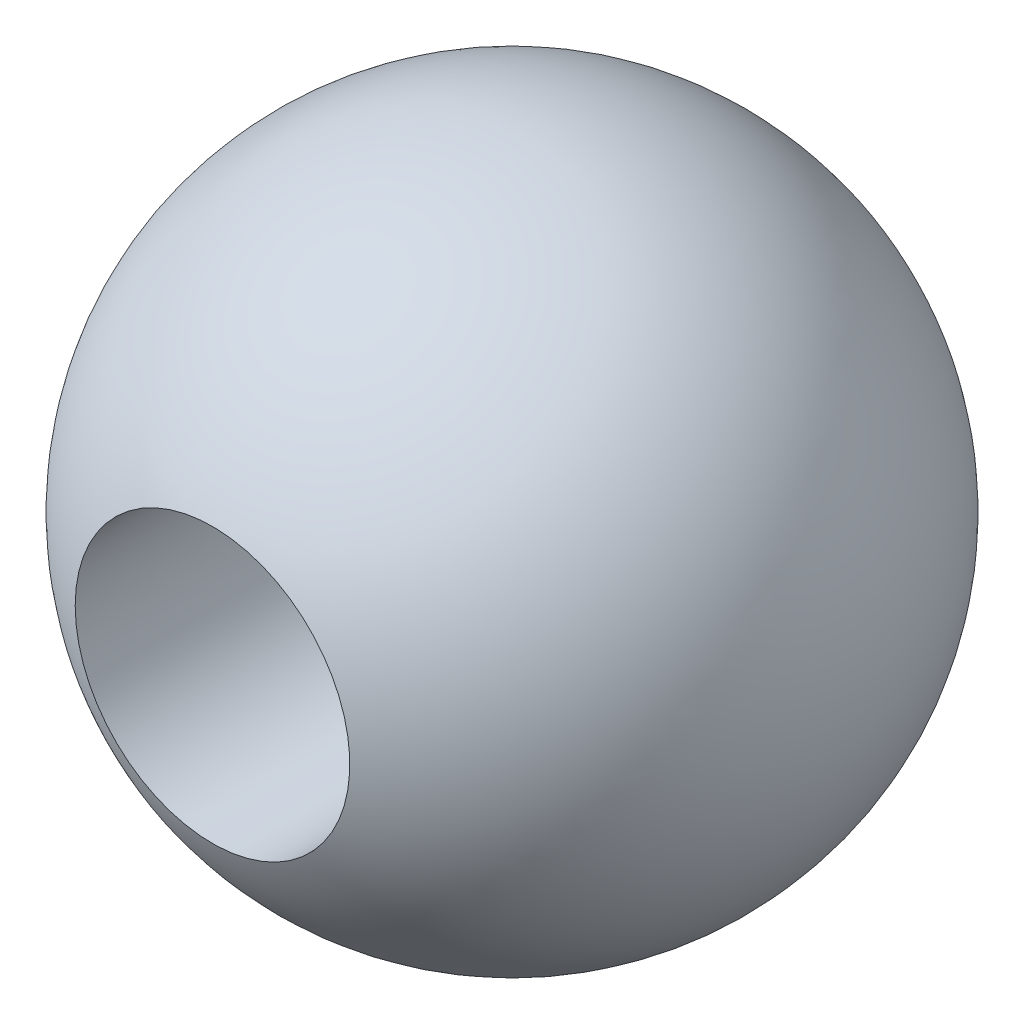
ISO-10303-21;
HEADER;
FILE_DESCRIPTION(('STEP AP214'),'2;1');
FILE_NAME('part.step','',(''),(''),'','','');
FILE_SCHEMA(('AUTOMOTIVE_DESIGN { 1 0 10303 214 1 1 1 1 }'));
ENDSEC;
DATA;
#1=APPLICATION_CONTEXT('core data for automotive mechanical design processes');
#2=APPLICATION_PROTOCOL_DEFINITION('international standard','automotive_design',2000,#1);
#3=PRODUCT_CONTEXT('',#1,'mechanical');
#4=PRODUCT('Part','Part','',(#3));
#5=PRODUCT_RELATED_PRODUCT_CATEGORY('part','',(#4));
#6=PRODUCT_DEFINITION_FORMATION('','',#4);
#7=PRODUCT_DEFINITION_CONTEXT('part definition',#1,'design');
#8=PRODUCT_DEFINITION('design','',#6,#7);
#9=PRODUCT_DEFINITION_SHAPE('','',#8);
#10=(LENGTH_UNIT() NAMED_UNIT(*) SI_UNIT(.MILLI.,.METRE.));
#11=(NAMED_UNIT(*) PLANE_ANGLE_UNIT() SI_UNIT($,.RADIAN.));
#12=(NAMED_UNIT(*) SI_UNIT($,.STERADIAN.) SOLID_ANGLE_UNIT());
#13=UNCERTAINTY_MEASURE_WITH_UNIT(LENGTH_MEASURE(1.E-05),#10,'distance_accuracy_value','');
#14=(GEOMETRIC_REPRESENTATION_CONTEXT(3) GLOBAL_UNCERTAINTY_ASSIGNED_CONTEXT((#13)) GLOBAL_UNIT_ASSIGNED_CONTEXT((#10,
#11,#12)) REPRESENTATION_CONTEXT('',''));
#15=CARTESIAN_POINT('',(0.,0.,0.));
#16=DIRECTION('',(0.,0.,1.));
#17=DIRECTION('',(1.,0.,0.));
#18=AXIS2_PLACEMENT_3D('',#15,#16,#17);
#19=CARTESIAN_POINT('',(0.,6.,0.));
#20=DIRECTION('',(0.,-1.,0.));
#21=DIRECTION('',(-1.,0.,0.));
#22=AXIS2_PLACEMENT_3D('',#19,#20,#21);
#23=SPHERICAL_SURFACE('',#22,6.);
#24=CARTESIAN_POINT('',(0.,6.,0.));
#25=DIRECTION('',(0.,0.,-1.));
#26=DIRECTION('',(-1.,0.,0.));
#27=AXIS2_PLACEMENT_3D('',#24,#25,#26);
#28=SPHERICAL_SURFACE('',#27,6.);
#29=CARTESIAN_POINT('',(0.,6.,5.45435605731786));
#30=DIRECTION('',(0.,0.,-1.));
#31=DIRECTION('',(-1.,0.,0.));
#32=AXIS2_PLACEMENT_3D('',#29,#30,#31);
#33=CIRCLE('',#32,2.5);
#34=CARTESIAN_POINT('',(-2.5,6.,5.45435605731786));
#35=VERTEX_POINT('',#34);
#36=EDGE_CURVE('E10',#35,#35,#33,.T.);
#37=ORIENTED_EDGE('',*,*,#36,.T.);
#38=EDGE_LOOP('',(#37));
#39=FACE_BOUND('',#38,.T.);
#40=ADVANCED_FACE('F35',(#39),#28,.T.);
#41=CARTESIAN_POINT('',(0.,6.,8.));
#42=DIRECTION('',(0.,0.,-1.));
#43=DIRECTION('',(-1.,0.,0.));
#44=AXIS2_PLACEMENT_3D('',#41,#42,#43);
#45=CYLINDRICAL_SURFACE('',#44,2.5);
#46=ORIENTED_EDGE('',*,*,#36,.F.);
#47=EDGE_LOOP('',(#46));
#48=FACE_BOUND('',#47,.T.);
#49=CARTESIAN_POINT('',(0.,6.,0.));
#50=DIRECTION('',(0.,0.,1.));
#51=DIRECTION('',(1.,0.,0.));
#52=AXIS2_PLACEMENT_3D('',#49,#50,#51);
#53=CIRCLE('',#52,2.5);
#54=CARTESIAN_POINT('',(2.5,6.,0.));
#55=VERTEX_POINT('',#54);
#56=EDGE_CURVE('E41',#55,#55,#53,.T.);
#57=ORIENTED_EDGE('',*,*,#56,.F.);
#58=EDGE_LOOP('',(#57));
#59=FACE_BOUND('',#58,.T.);
#60=ADVANCED_FACE('F49',(#48,#59),#45,.F.);
#61=CARTESIAN_POINT('',(0.,6.,0.));
#62=DIRECTION('',(0.,0.,1.));
#63=DIRECTION('',(1.,0.,0.));
#64=AXIS2_PLACEMENT_3D('',#61,#62,#63);
#65=PLANE('',#64);
#66=ORIENTED_EDGE('',*,*,#56,.T.);
#67=EDGE_LOOP('',(#66));
#68=FACE_BOUND('',#67,.T.);
#69=ADVANCED_FACE('F47',(#68),#65,.T.);
#70=CLOSED_SHELL('',(#40,#60,#69));
#71=MANIFOLD_SOLID_BREP('B2',#70);
#72=ADVANCED_BREP_SHAPE_REPRESENTATION('',(#18,#71),#14);
#73=SHAPE_DEFINITION_REPRESENTATION(#9,#72);
ENDSEC;
END-ISO-10303-21;
